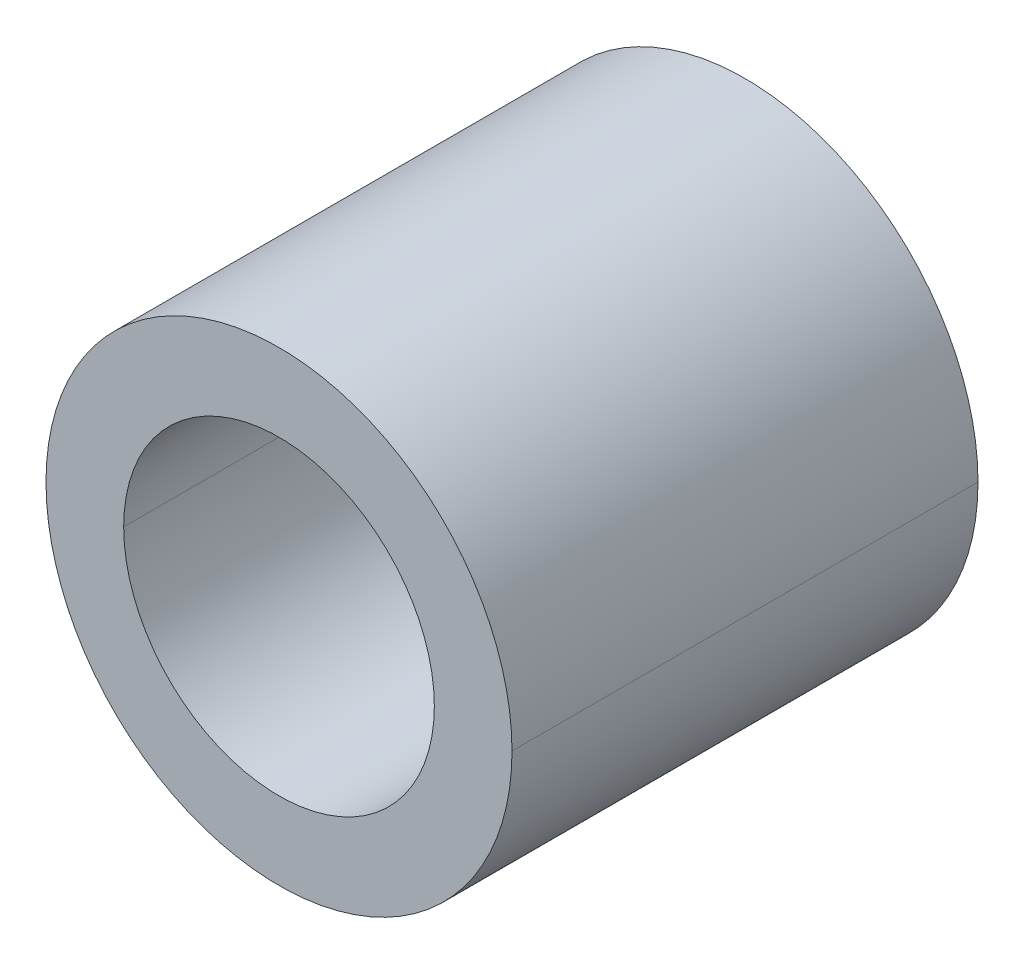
ISO-10303-21;
HEADER;
FILE_DESCRIPTION(('STEP AP214'),'2;1');
FILE_NAME('part.step','',(''),(''),'','','');
FILE_SCHEMA(('AUTOMOTIVE_DESIGN { 1 0 10303 214 1 1 1 1 }'));
ENDSEC;
DATA;
#1=APPLICATION_CONTEXT('core data for automotive mechanical design processes');
#2=APPLICATION_PROTOCOL_DEFINITION('international standard','automotive_design',2000,#1);
#3=PRODUCT_CONTEXT('',#1,'mechanical');
#4=PRODUCT('Part','Part','',(#3));
#5=PRODUCT_RELATED_PRODUCT_CATEGORY('part','',(#4));
#6=PRODUCT_DEFINITION_FORMATION('','',#4);
#7=PRODUCT_DEFINITION_CONTEXT('part definition',#1,'design');
#8=PRODUCT_DEFINITION('design','',#6,#7);
#9=PRODUCT_DEFINITION_SHAPE('','',#8);
#10=(LENGTH_UNIT() NAMED_UNIT(*) SI_UNIT(.MILLI.,.METRE.));
#11=(NAMED_UNIT(*) PLANE_ANGLE_UNIT() SI_UNIT($,.RADIAN.));
#12=(NAMED_UNIT(*) SI_UNIT($,.STERADIAN.) SOLID_ANGLE_UNIT());
#13=UNCERTAINTY_MEASURE_WITH_UNIT(LENGTH_MEASURE(1.E-05),#10,'distance_accuracy_value','');
#14=(GEOMETRIC_REPRESENTATION_CONTEXT(3) GLOBAL_UNCERTAINTY_ASSIGNED_CONTEXT((#13)) GLOBAL_UNIT_ASSIGNED_CONTEXT((#10,
#11,#12)) REPRESENTATION_CONTEXT('',''));
#15=CARTESIAN_POINT('',(0.,0.,0.));
#16=DIRECTION('',(0.,0.,1.));
#17=DIRECTION('',(1.,0.,0.));
#18=AXIS2_PLACEMENT_3D('',#15,#16,#17);
#19=CARTESIAN_POINT('',(0.,0.,3.175));
#20=DIRECTION('',(0.,0.,1.));
#21=DIRECTION('',(1.,0.,0.));
#22=AXIS2_PLACEMENT_3D('',#19,#20,#21);
#23=CYLINDRICAL_SURFACE('',#22,6.35);
#24=CARTESIAN_POINT('',(0.,0.,-9.525));
#25=DIRECTION('',(0.,0.,1.));
#26=DIRECTION('',(1.,0.,0.));
#27=AXIS2_PLACEMENT_3D('',#24,#25,#26);
#28=CIRCLE('',#27,6.35);
#29=CARTESIAN_POINT('',(-6.34999999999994,0.,-9.525));
#30=VERTEX_POINT('',#29);
#31=CARTESIAN_POINT('',(6.35000000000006,0.,-9.525));
#32=VERTEX_POINT('',#31);
#33=EDGE_CURVE('E67',#30,#32,#28,.T.);
#34=ORIENTED_EDGE('',*,*,#33,.F.);
#35=DIRECTION('',(0.,0.,1.));
#36=VECTOR('',#35,1.);
#37=CARTESIAN_POINT('',(-6.34999999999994,0.,3.175));
#38=LINE('',#37,#36);
#39=CARTESIAN_POINT('',(-6.34999999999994,0.,9.525));
#40=VERTEX_POINT('',#39);
#41=EDGE_CURVE('E59',#30,#40,#38,.T.);
#42=ORIENTED_EDGE('',*,*,#41,.T.);
#43=CARTESIAN_POINT('',(0.,0.,9.525));
#44=DIRECTION('',(0.,0.,1.));
#45=DIRECTION('',(1.,0.,0.));
#46=AXIS2_PLACEMENT_3D('',#43,#44,#45);
#47=CIRCLE('',#46,6.35);
#48=CARTESIAN_POINT('',(6.35000000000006,0.,9.525));
#49=VERTEX_POINT('',#48);
#50=EDGE_CURVE('E80',#49,#40,#47,.F.);
#51=ORIENTED_EDGE('',*,*,#50,.F.);
#52=DIRECTION('',(0.,0.,1.));
#53=VECTOR('',#52,1.);
#54=CARTESIAN_POINT('',(6.35000000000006,0.,3.175));
#55=LINE('',#54,#53);
#56=EDGE_CURVE('E54',#49,#32,#55,.F.);
#57=ORIENTED_EDGE('',*,*,#56,.T.);
#58=EDGE_LOOP('',(#34,#42,#51,#57));
#59=FACE_BOUND('',#58,.T.);
#60=ADVANCED_FACE('F16',(#59),#23,.F.);
#61=CARTESIAN_POINT('',(0.,0.,3.175));
#62=DIRECTION('',(0.,0.,1.));
#63=DIRECTION('',(1.,0.,0.));
#64=AXIS2_PLACEMENT_3D('',#61,#62,#63);
#65=CYLINDRICAL_SURFACE('',#64,6.35);
#66=CARTESIAN_POINT('',(0.,0.,9.525));
#67=DIRECTION('',(0.,0.,1.));
#68=DIRECTION('',(1.,0.,0.));
#69=AXIS2_PLACEMENT_3D('',#66,#67,#68);
#70=CIRCLE('',#69,6.35);
#71=EDGE_CURVE('E64',#40,#49,#70,.F.);
#72=ORIENTED_EDGE('',*,*,#71,.F.);
#73=ORIENTED_EDGE('',*,*,#41,.F.);
#74=CARTESIAN_POINT('',(0.,0.,-9.525));
#75=DIRECTION('',(0.,0.,1.));
#76=DIRECTION('',(1.,0.,0.));
#77=AXIS2_PLACEMENT_3D('',#74,#75,#76);
#78=CIRCLE('',#77,6.35);
#79=EDGE_CURVE('E19',#32,#30,#78,.T.);
#80=ORIENTED_EDGE('',*,*,#79,.F.);
#81=ORIENTED_EDGE('',*,*,#56,.F.);
#82=EDGE_LOOP('',(#72,#73,#80,#81));
#83=FACE_BOUND('',#82,.T.);
#84=ADVANCED_FACE('F60',(#83),#65,.F.);
#85=CARTESIAN_POINT('',(0.,0.,-9.525));
#86=DIRECTION('',(0.,0.,-1.));
#87=DIRECTION('',(-1.,0.,0.));
#88=AXIS2_PLACEMENT_3D('',#85,#86,#87);
#89=PLANE('',#88);
#90=CARTESIAN_POINT('',(0.,0.,-9.525));
#91=DIRECTION('',(0.,0.,1.));
#92=DIRECTION('',(1.,0.,0.));
#93=AXIS2_PLACEMENT_3D('',#90,#91,#92);
#94=CIRCLE('',#93,9.525);
#95=CARTESIAN_POINT('',(-9.52499999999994,0.,-9.525));
#96=VERTEX_POINT('',#95);
#97=CARTESIAN_POINT('',(9.52500000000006,0.,-9.525));
#98=VERTEX_POINT('',#97);
#99=EDGE_CURVE('E69',#96,#98,#94,.T.);
#100=ORIENTED_EDGE('',*,*,#99,.F.);
#101=CARTESIAN_POINT('',(0.,0.,-9.525));
#102=DIRECTION('',(0.,0.,1.));
#103=DIRECTION('',(1.,0.,0.));
#104=AXIS2_PLACEMENT_3D('',#101,#102,#103);
#105=CIRCLE('',#104,9.525);
#106=EDGE_CURVE('E74',#98,#96,#105,.T.);
#107=ORIENTED_EDGE('',*,*,#106,.F.);
#108=EDGE_LOOP('',(#100,#107));
#109=FACE_BOUND('',#108,.T.);
#110=ORIENTED_EDGE('',*,*,#79,.T.);
#111=ORIENTED_EDGE('',*,*,#33,.T.);
#112=EDGE_LOOP('',(#110,#111));
#113=FACE_BOUND('',#112,.T.);
#114=ADVANCED_FACE('F70',(#109,#113),#89,.T.);
#115=CARTESIAN_POINT('',(0.,0.,3.175));
#116=DIRECTION('',(0.,0.,1.));
#117=DIRECTION('',(1.,0.,0.));
#118=AXIS2_PLACEMENT_3D('',#115,#116,#117);
#119=CYLINDRICAL_SURFACE('',#118,9.525);
#120=DIRECTION('',(0.,0.,1.));
#121=VECTOR('',#120,1.);
#122=CARTESIAN_POINT('',(-9.52499999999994,0.,3.175));
#123=LINE('',#122,#121);
#124=CARTESIAN_POINT('',(-9.52499999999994,0.,9.525));
#125=VERTEX_POINT('',#124);
#126=EDGE_CURVE('E25',#96,#125,#123,.T.);
#127=ORIENTED_EDGE('',*,*,#126,.F.);
#128=ORIENTED_EDGE('',*,*,#99,.T.);
#129=DIRECTION('',(0.,0.,1.));
#130=VECTOR('',#129,1.);
#131=CARTESIAN_POINT('',(9.52500000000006,0.,3.175));
#132=LINE('',#131,#130);
#133=CARTESIAN_POINT('',(9.52500000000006,0.,9.525));
#134=VERTEX_POINT('',#133);
#135=EDGE_CURVE('E77',#134,#98,#132,.F.);
#136=ORIENTED_EDGE('',*,*,#135,.F.);
#137=CARTESIAN_POINT('',(0.,0.,9.525));
#138=DIRECTION('',(0.,0.,1.));
#139=DIRECTION('',(1.,0.,0.));
#140=AXIS2_PLACEMENT_3D('',#137,#138,#139);
#141=CIRCLE('',#140,9.525);
#142=EDGE_CURVE('E34',#125,#134,#141,.T.);
#143=ORIENTED_EDGE('',*,*,#142,.F.);
#144=EDGE_LOOP('',(#127,#128,#136,#143));
#145=FACE_BOUND('',#144,.T.);
#146=ADVANCED_FACE('F83',(#145),#119,.T.);
#147=CARTESIAN_POINT('',(-3.01736413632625E-13,0.,9.525));
#148=DIRECTION('',(0.,0.,1.));
#149=DIRECTION('',(1.,0.,0.));
#150=AXIS2_PLACEMENT_3D('',#147,#148,#149);
#151=PLANE('',#150);
#152=CARTESIAN_POINT('',(0.,0.,9.525));
#153=DIRECTION('',(0.,0.,1.));
#154=DIRECTION('',(1.,0.,0.));
#155=AXIS2_PLACEMENT_3D('',#152,#153,#154);
#156=CIRCLE('',#155,9.525);
#157=EDGE_CURVE('E11',#125,#134,#156,.F.);
#158=ORIENTED_EDGE('',*,*,#157,.F.);
#159=ORIENTED_EDGE('',*,*,#142,.T.);
#160=EDGE_LOOP('',(#158,#159));
#161=FACE_BOUND('',#160,.T.);
#162=ORIENTED_EDGE('',*,*,#50,.T.);
#163=ORIENTED_EDGE('',*,*,#71,.T.);
#164=EDGE_LOOP('',(#162,#163));
#165=FACE_BOUND('',#164,.T.);
#166=ADVANCED_FACE('F91',(#161,#165),#151,.T.);
#167=CARTESIAN_POINT('',(0.,0.,3.175));
#168=DIRECTION('',(0.,0.,1.));
#169=DIRECTION('',(1.,0.,0.));
#170=AXIS2_PLACEMENT_3D('',#167,#168,#169);
#171=CYLINDRICAL_SURFACE('',#170,9.525);
#172=ORIENTED_EDGE('',*,*,#126,.T.);
#173=ORIENTED_EDGE('',*,*,#157,.T.);
#174=ORIENTED_EDGE('',*,*,#135,.T.);
#175=ORIENTED_EDGE('',*,*,#106,.T.);
#176=EDGE_LOOP('',(#172,#173,#174,#175));
#177=FACE_BOUND('',#176,.T.);
#178=ADVANCED_FACE('F88',(#177),#171,.T.);
#179=CLOSED_SHELL('',(#60,#84,#114,#146,#166,#178));
#180=MANIFOLD_SOLID_BREP('B1',#179);
#181=ADVANCED_BREP_SHAPE_REPRESENTATION('',(#18,#180),#14);
#182=SHAPE_DEFINITION_REPRESENTATION(#9,#181);
ENDSEC;
END-ISO-10303-21;
